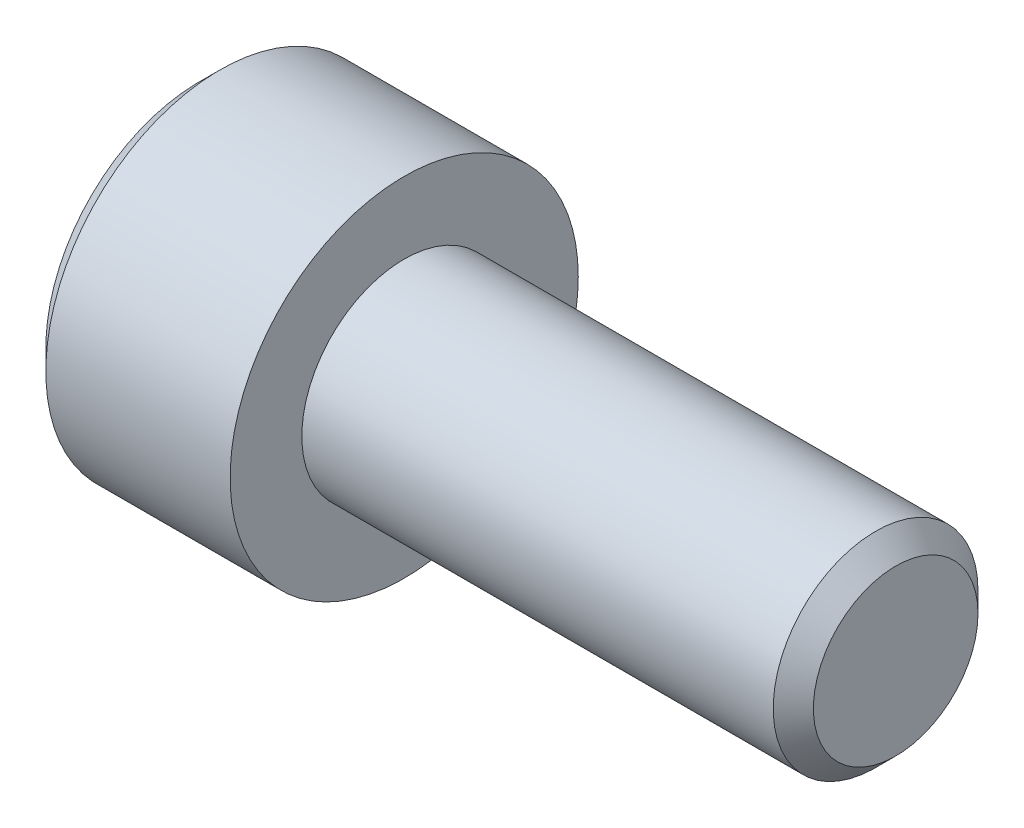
ISO-10303-21;
HEADER;
FILE_DESCRIPTION(('STEP AP214'),'2;1');
FILE_NAME('part.step','',(''),(''),'','','');
FILE_SCHEMA(('AUTOMOTIVE_DESIGN { 1 0 10303 214 1 1 1 1 }'));
ENDSEC;
DATA;
#1=APPLICATION_CONTEXT('core data for automotive mechanical design processes');
#2=APPLICATION_PROTOCOL_DEFINITION('international standard','automotive_design',2000,#1);
#3=PRODUCT_CONTEXT('',#1,'mechanical');
#4=PRODUCT('Part','Part','',(#3));
#5=PRODUCT_RELATED_PRODUCT_CATEGORY('part','',(#4));
#6=PRODUCT_DEFINITION_FORMATION('','',#4);
#7=PRODUCT_DEFINITION_CONTEXT('part definition',#1,'design');
#8=PRODUCT_DEFINITION('design','',#6,#7);
#9=PRODUCT_DEFINITION_SHAPE('','',#8);
#10=(LENGTH_UNIT() NAMED_UNIT(*) SI_UNIT(.MILLI.,.METRE.));
#11=(NAMED_UNIT(*) PLANE_ANGLE_UNIT() SI_UNIT($,.RADIAN.));
#12=(NAMED_UNIT(*) SI_UNIT($,.STERADIAN.) SOLID_ANGLE_UNIT());
#13=UNCERTAINTY_MEASURE_WITH_UNIT(LENGTH_MEASURE(1.E-05),#10,'distance_accuracy_value','');
#14=(GEOMETRIC_REPRESENTATION_CONTEXT(3) GLOBAL_UNCERTAINTY_ASSIGNED_CONTEXT((#13)) GLOBAL_UNIT_ASSIGNED_CONTEXT((#10,
#11,#12)) REPRESENTATION_CONTEXT('',''));
#15=CARTESIAN_POINT('',(0.,0.,0.));
#16=DIRECTION('',(0.,0.,1.));
#17=DIRECTION('',(1.,0.,0.));
#18=AXIS2_PLACEMENT_3D('',#15,#16,#17);
#19=CARTESIAN_POINT('',(-5.,0.,0.));
#20=DIRECTION('',(1.,0.,0.));
#21=DIRECTION('',(0.,0.,-1.));
#22=AXIS2_PLACEMENT_3D('',#19,#20,#21);
#23=PLANE('',#22);
#24=CARTESIAN_POINT('',(-5.,0.,0.));
#25=DIRECTION('',(1.,0.,0.));
#26=DIRECTION('',(0.,0.,-1.));
#27=AXIS2_PLACEMENT_3D('',#24,#25,#26);
#28=CIRCLE('',#27,3.75);
#29=CARTESIAN_POINT('',(-5.,0.,-3.75));
#30=VERTEX_POINT('',#29);
#31=EDGE_CURVE('E10',#30,#30,#28,.T.);
#32=ORIENTED_EDGE('',*,*,#31,.F.);
#33=EDGE_LOOP('',(#32));
#34=FACE_BOUND('',#33,.T.);
#35=DIRECTION('',(0.,0.5,-0.866025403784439));
#36=VECTOR('',#35,1.);
#37=CARTESIAN_POINT('',(-5.,-2.3094010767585,0.));
#38=LINE('',#37,#36);
#39=CARTESIAN_POINT('',(-5.,-2.3094010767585,0.));
#40=VERTEX_POINT('',#39);
#41=CARTESIAN_POINT('',(-5.,-1.15470053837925,-2.));
#42=VERTEX_POINT('',#41);
#43=EDGE_CURVE('E152',#40,#42,#38,.T.);
#44=ORIENTED_EDGE('',*,*,#43,.T.);
#45=DIRECTION('',(0.,1.,0.));
#46=VECTOR('',#45,1.);
#47=CARTESIAN_POINT('',(-5.,-1.15470053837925,-2.));
#48=LINE('',#47,#46);
#49=CARTESIAN_POINT('',(-5.,1.15470053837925,-2.));
#50=VERTEX_POINT('',#49);
#51=EDGE_CURVE('E154',#42,#50,#48,.T.);
#52=ORIENTED_EDGE('',*,*,#51,.T.);
#53=DIRECTION('',(0.,0.5,0.866025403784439));
#54=VECTOR('',#53,1.);
#55=CARTESIAN_POINT('',(-5.,1.15470053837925,-2.));
#56=LINE('',#55,#54);
#57=CARTESIAN_POINT('',(-5.,2.3094010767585,0.));
#58=VERTEX_POINT('',#57);
#59=EDGE_CURVE('E157',#50,#58,#56,.T.);
#60=ORIENTED_EDGE('',*,*,#59,.T.);
#61=DIRECTION('',(0.,-0.5,0.866025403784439));
#62=VECTOR('',#61,1.);
#63=CARTESIAN_POINT('',(-5.,2.3094010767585,0.));
#64=LINE('',#63,#62);
#65=CARTESIAN_POINT('',(-5.,1.15470053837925,2.));
#66=VERTEX_POINT('',#65);
#67=EDGE_CURVE('E99',#58,#66,#64,.T.);
#68=ORIENTED_EDGE('',*,*,#67,.T.);
#69=DIRECTION('',(0.,-1.,0.));
#70=VECTOR('',#69,1.);
#71=CARTESIAN_POINT('',(-5.,1.15470053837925,2.));
#72=LINE('',#71,#70);
#73=CARTESIAN_POINT('',(-5.,-1.15470053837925,2.));
#74=VERTEX_POINT('',#73);
#75=EDGE_CURVE('E159',#66,#74,#72,.T.);
#76=ORIENTED_EDGE('',*,*,#75,.T.);
#77=DIRECTION('',(0.,-0.5,-0.866025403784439));
#78=VECTOR('',#77,1.);
#79=CARTESIAN_POINT('',(-5.,-1.15470053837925,2.));
#80=LINE('',#79,#78);
#81=EDGE_CURVE('E114',#74,#40,#80,.T.);
#82=ORIENTED_EDGE('',*,*,#81,.T.);
#83=EDGE_LOOP('',(#44,#52,#60,#68,#76,#82));
#84=FACE_BOUND('',#83,.T.);
#85=ADVANCED_FACE('F16',(#34,#84),#23,.F.);
#86=CARTESIAN_POINT('',(-5.,0.,0.));
#87=DIRECTION('',(1.,0.,0.));
#88=DIRECTION('',(0.,0.,-1.));
#89=AXIS2_PLACEMENT_3D('',#86,#87,#88);
#90=CONICAL_SURFACE('',#89,3.75,0.785398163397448);
#91=CARTESIAN_POINT('',(-4.5,0.,0.));
#92=DIRECTION('',(1.,0.,0.));
#93=DIRECTION('',(0.,0.,-1.));
#94=AXIS2_PLACEMENT_3D('',#91,#92,#93);
#95=CIRCLE('',#94,4.25);
#96=CARTESIAN_POINT('',(-4.5,0.,-4.25));
#97=VERTEX_POINT('',#96);
#98=EDGE_CURVE('E23',#97,#97,#95,.T.);
#99=ORIENTED_EDGE('',*,*,#98,.F.);
#100=EDGE_LOOP('',(#99));
#101=FACE_BOUND('',#100,.T.);
#102=ORIENTED_EDGE('',*,*,#31,.T.);
#103=EDGE_LOOP('',(#102));
#104=FACE_BOUND('',#103,.T.);
#105=ADVANCED_FACE('F143',(#101,#104),#90,.T.);
#106=CARTESIAN_POINT('',(12.,0.,0.));
#107=DIRECTION('',(1.,0.,0.));
#108=DIRECTION('',(0.,0.,-1.));
#109=AXIS2_PLACEMENT_3D('',#106,#107,#108);
#110=CYLINDRICAL_SURFACE('',#109,4.25);
#111=CARTESIAN_POINT('',(0.,0.,0.));
#112=DIRECTION('',(1.,0.,0.));
#113=DIRECTION('',(0.,0.,-1.));
#114=AXIS2_PLACEMENT_3D('',#111,#112,#113);
#115=CIRCLE('',#114,4.25);
#116=CARTESIAN_POINT('',(0.,0.,-4.25));
#117=VERTEX_POINT('',#116);
#118=EDGE_CURVE('E136',#117,#117,#115,.T.);
#119=ORIENTED_EDGE('',*,*,#118,.F.);
#120=EDGE_LOOP('',(#119));
#121=FACE_BOUND('',#120,.T.);
#122=ORIENTED_EDGE('',*,*,#98,.T.);
#123=EDGE_LOOP('',(#122));
#124=FACE_BOUND('',#123,.T.);
#125=ADVANCED_FACE('F141',(#121,#124),#110,.T.);
#126=CARTESIAN_POINT('',(0.,4.25,0.));
#127=DIRECTION('',(-1.,0.,0.));
#128=DIRECTION('',(0.,0.,1.));
#129=AXIS2_PLACEMENT_3D('',#126,#127,#128);
#130=PLANE('',#129);
#131=CARTESIAN_POINT('',(0.,0.,0.));
#132=DIRECTION('',(1.,0.,0.));
#133=DIRECTION('',(0.,0.,-1.));
#134=AXIS2_PLACEMENT_3D('',#131,#132,#133);
#135=CIRCLE('',#134,2.5);
#136=CARTESIAN_POINT('',(0.,0.,-2.5));
#137=VERTEX_POINT('',#136);
#138=EDGE_CURVE('E133',#137,#137,#135,.T.);
#139=ORIENTED_EDGE('',*,*,#138,.F.);
#140=EDGE_LOOP('',(#139));
#141=FACE_BOUND('',#140,.T.);
#142=ORIENTED_EDGE('',*,*,#118,.T.);
#143=EDGE_LOOP('',(#142));
#144=FACE_BOUND('',#143,.T.);
#145=ADVANCED_FACE('F250',(#141,#144),#130,.F.);
#146=CARTESIAN_POINT('',(12.,0.,0.));
#147=DIRECTION('',(1.,0.,0.));
#148=DIRECTION('',(0.,0.,-1.));
#149=AXIS2_PLACEMENT_3D('',#146,#147,#148);
#150=CYLINDRICAL_SURFACE('',#149,2.5);
#151=CARTESIAN_POINT('',(11.5095,0.,0.));
#152=DIRECTION('',(1.,0.,0.));
#153=DIRECTION('',(0.,0.,-1.));
#154=AXIS2_PLACEMENT_3D('',#151,#152,#153);
#155=CIRCLE('',#154,2.5);
#156=CARTESIAN_POINT('',(11.5095,0.,-2.5));
#157=VERTEX_POINT('',#156);
#158=EDGE_CURVE('E130',#157,#157,#155,.T.);
#159=ORIENTED_EDGE('',*,*,#158,.F.);
#160=EDGE_LOOP('',(#159));
#161=FACE_BOUND('',#160,.T.);
#162=ORIENTED_EDGE('',*,*,#138,.T.);
#163=EDGE_LOOP('',(#162));
#164=FACE_BOUND('',#163,.T.);
#165=ADVANCED_FACE('F246',(#161,#164),#150,.T.);
#166=CARTESIAN_POINT('',(11.5095,0.,0.));
#167=DIRECTION('',(-1.,0.,0.));
#168=DIRECTION('',(0.,0.,1.));
#169=AXIS2_PLACEMENT_3D('',#166,#167,#168);
#170=CONICAL_SURFACE('',#169,2.5,0.785398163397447);
#171=CARTESIAN_POINT('',(12.,0.,0.));
#172=DIRECTION('',(1.,0.,0.));
#173=DIRECTION('',(0.,0.,-1.));
#174=AXIS2_PLACEMENT_3D('',#171,#172,#173);
#175=CIRCLE('',#174,2.0095);
#176=CARTESIAN_POINT('',(12.,0.,-2.0095));
#177=VERTEX_POINT('',#176);
#178=EDGE_CURVE('E126',#177,#177,#175,.T.);
#179=ORIENTED_EDGE('',*,*,#178,.F.);
#180=EDGE_LOOP('',(#179));
#181=FACE_BOUND('',#180,.T.);
#182=ORIENTED_EDGE('',*,*,#158,.T.);
#183=EDGE_LOOP('',(#182));
#184=FACE_BOUND('',#183,.T.);
#185=ADVANCED_FACE('F242',(#181,#184),#170,.T.);
#186=CARTESIAN_POINT('',(12.,2.0095,0.));
#187=DIRECTION('',(-1.,0.,0.));
#188=DIRECTION('',(0.,0.,1.));
#189=AXIS2_PLACEMENT_3D('',#186,#187,#188);
#190=PLANE('',#189);
#191=ORIENTED_EDGE('',*,*,#178,.T.);
#192=EDGE_LOOP('',(#191));
#193=FACE_BOUND('',#192,.T.);
#194=ADVANCED_FACE('F237',(#193),#190,.F.);
#195=CARTESIAN_POINT('',(-2.5,1.15470053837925,2.));
#196=DIRECTION('',(0.,0.,-1.));
#197=DIRECTION('',(-1.,0.,0.));
#198=AXIS2_PLACEMENT_3D('',#195,#196,#197);
#199=PLANE('',#198);
#200=ORIENTED_EDGE('',*,*,#75,.F.);
#201=DIRECTION('',(-1.,0.,0.));
#202=VECTOR('',#201,1.);
#203=CARTESIAN_POINT('',(-2.5,1.15470053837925,2.));
#204=LINE('',#203,#202);
#205=CARTESIAN_POINT('',(-2.5,1.15470053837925,2.));
#206=VERTEX_POINT('',#205);
#207=EDGE_CURVE('E166',#206,#66,#204,.T.);
#208=ORIENTED_EDGE('',*,*,#207,.F.);
#209=DIRECTION('',(0.,-1.,0.));
#210=VECTOR('',#209,1.);
#211=CARTESIAN_POINT('',(-2.5,1.15470053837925,2.));
#212=LINE('',#211,#210);
#213=CARTESIAN_POINT('',(-2.5,0.,2.));
#214=VERTEX_POINT('',#213);
#215=EDGE_CURVE('E96',#206,#214,#212,.T.);
#216=ORIENTED_EDGE('',*,*,#215,.T.);
#217=CARTESIAN_POINT('',(-2.5,-1.15470053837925,2.));
#218=VERTEX_POINT('',#217);
#219=EDGE_CURVE('E88',#214,#218,#212,.T.);
#220=ORIENTED_EDGE('',*,*,#219,.T.);
#221=DIRECTION('',(-1.,0.,0.));
#222=VECTOR('',#221,1.);
#223=CARTESIAN_POINT('',(-2.5,-1.15470053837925,2.));
#224=LINE('',#223,#222);
#225=EDGE_CURVE('E92',#218,#74,#224,.T.);
#226=ORIENTED_EDGE('',*,*,#225,.T.);
#227=EDGE_LOOP('',(#200,#208,#216,#220,#226));
#228=FACE_BOUND('',#227,.T.);
#229=ADVANCED_FACE('F90',(#228),#199,.T.);
#230=CARTESIAN_POINT('',(-2.5,-1.15470053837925,2.));
#231=DIRECTION('',(0.,0.866025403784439,-0.5));
#232=DIRECTION('',(0.,0.5,0.866025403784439));
#233=AXIS2_PLACEMENT_3D('',#230,#231,#232);
#234=PLANE('',#233);
#235=ORIENTED_EDGE('',*,*,#81,.F.);
#236=ORIENTED_EDGE('',*,*,#225,.F.);
#237=DIRECTION('',(0.,-0.5,-0.866025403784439));
#238=VECTOR('',#237,1.);
#239=CARTESIAN_POINT('',(-2.5,-1.15470053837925,2.));
#240=LINE('',#239,#238);
#241=CARTESIAN_POINT('',(-2.5,-1.73205080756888,1.));
#242=VERTEX_POINT('',#241);
#243=EDGE_CURVE('E102',#218,#242,#240,.T.);
#244=ORIENTED_EDGE('',*,*,#243,.T.);
#245=CARTESIAN_POINT('',(-2.5,-2.3094010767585,0.));
#246=VERTEX_POINT('',#245);
#247=EDGE_CURVE('E109',#242,#246,#240,.T.);
#248=ORIENTED_EDGE('',*,*,#247,.T.);
#249=DIRECTION('',(-1.,0.,0.));
#250=VECTOR('',#249,1.);
#251=CARTESIAN_POINT('',(-2.5,-2.3094010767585,0.));
#252=LINE('',#251,#250);
#253=EDGE_CURVE('E116',#246,#40,#252,.T.);
#254=ORIENTED_EDGE('',*,*,#253,.T.);
#255=EDGE_LOOP('',(#235,#236,#244,#248,#254));
#256=FACE_BOUND('',#255,.T.);
#257=ADVANCED_FACE('F111',(#256),#234,.T.);
#258=CARTESIAN_POINT('',(-2.5,-2.3094010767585,0.));
#259=DIRECTION('',(0.,0.866025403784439,0.5));
#260=DIRECTION('',(0.,-0.5,0.866025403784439));
#261=AXIS2_PLACEMENT_3D('',#258,#259,#260);
#262=PLANE('',#261);
#263=ORIENTED_EDGE('',*,*,#43,.F.);
#264=ORIENTED_EDGE('',*,*,#253,.F.);
#265=DIRECTION('',(0.,0.5,-0.866025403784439));
#266=VECTOR('',#265,1.);
#267=CARTESIAN_POINT('',(-2.5,-2.3094010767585,0.));
#268=LINE('',#267,#266);
#269=CARTESIAN_POINT('',(-2.5,-1.73205080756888,-1.));
#270=VERTEX_POINT('',#269);
#271=EDGE_CURVE('E30',#246,#270,#268,.T.);
#272=ORIENTED_EDGE('',*,*,#271,.T.);
#273=CARTESIAN_POINT('',(-2.5,-1.15470053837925,-2.));
#274=VERTEX_POINT('',#273);
#275=EDGE_CURVE('E108',#270,#274,#268,.T.);
#276=ORIENTED_EDGE('',*,*,#275,.T.);
#277=DIRECTION('',(-1.,0.,0.));
#278=VECTOR('',#277,1.);
#279=CARTESIAN_POINT('',(-2.5,-1.15470053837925,-2.));
#280=LINE('',#279,#278);
#281=EDGE_CURVE('E122',#274,#42,#280,.T.);
#282=ORIENTED_EDGE('',*,*,#281,.T.);
#283=EDGE_LOOP('',(#263,#264,#272,#276,#282));
#284=FACE_BOUND('',#283,.T.);
#285=ADVANCED_FACE('F176',(#284),#262,.T.);
#286=CARTESIAN_POINT('',(-2.5,-1.15470053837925,-2.));
#287=DIRECTION('',(0.,0.,1.));
#288=DIRECTION('',(1.,0.,0.));
#289=AXIS2_PLACEMENT_3D('',#286,#287,#288);
#290=PLANE('',#289);
#291=ORIENTED_EDGE('',*,*,#51,.F.);
#292=ORIENTED_EDGE('',*,*,#281,.F.);
#293=DIRECTION('',(0.,1.,0.));
#294=VECTOR('',#293,1.);
#295=CARTESIAN_POINT('',(-2.5,-1.15470053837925,-2.));
#296=LINE('',#295,#294);
#297=CARTESIAN_POINT('',(-2.5,0.,-2.));
#298=VERTEX_POINT('',#297);
#299=EDGE_CURVE('E181',#274,#298,#296,.T.);
#300=ORIENTED_EDGE('',*,*,#299,.T.);
#301=CARTESIAN_POINT('',(-2.5,1.15470053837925,-2.));
#302=VERTEX_POINT('',#301);
#303=EDGE_CURVE('E189',#298,#302,#296,.T.);
#304=ORIENTED_EDGE('',*,*,#303,.T.);
#305=DIRECTION('',(-1.,0.,0.));
#306=VECTOR('',#305,1.);
#307=CARTESIAN_POINT('',(-2.5,1.15470053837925,-2.));
#308=LINE('',#307,#306);
#309=EDGE_CURVE('E173',#302,#50,#308,.T.);
#310=ORIENTED_EDGE('',*,*,#309,.T.);
#311=EDGE_LOOP('',(#291,#292,#300,#304,#310));
#312=FACE_BOUND('',#311,.T.);
#313=ADVANCED_FACE('F180',(#312),#290,.T.);
#314=CARTESIAN_POINT('',(-2.5,1.15470053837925,-2.));
#315=DIRECTION('',(0.,-0.866025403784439,0.5));
#316=DIRECTION('',(0.,-0.5,-0.866025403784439));
#317=AXIS2_PLACEMENT_3D('',#314,#315,#316);
#318=PLANE('',#317);
#319=ORIENTED_EDGE('',*,*,#59,.F.);
#320=ORIENTED_EDGE('',*,*,#309,.F.);
#321=DIRECTION('',(0.,0.5,0.866025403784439));
#322=VECTOR('',#321,1.);
#323=CARTESIAN_POINT('',(-2.5,1.15470053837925,-2.));
#324=LINE('',#323,#322);
#325=CARTESIAN_POINT('',(-2.5,1.73205080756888,-1.));
#326=VERTEX_POINT('',#325);
#327=EDGE_CURVE('E191',#302,#326,#324,.T.);
#328=ORIENTED_EDGE('',*,*,#327,.T.);
#329=CARTESIAN_POINT('',(-2.5,2.3094010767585,0.));
#330=VERTEX_POINT('',#329);
#331=EDGE_CURVE('E188',#326,#330,#324,.T.);
#332=ORIENTED_EDGE('',*,*,#331,.T.);
#333=DIRECTION('',(-1.,0.,0.));
#334=VECTOR('',#333,1.);
#335=CARTESIAN_POINT('',(-2.5,2.3094010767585,0.));
#336=LINE('',#335,#334);
#337=EDGE_CURVE('E169',#330,#58,#336,.T.);
#338=ORIENTED_EDGE('',*,*,#337,.T.);
#339=EDGE_LOOP('',(#319,#320,#328,#332,#338));
#340=FACE_BOUND('',#339,.T.);
#341=ADVANCED_FACE('F219',(#340),#318,.T.);
#342=CARTESIAN_POINT('',(-2.5,2.3094010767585,0.));
#343=DIRECTION('',(0.,-0.866025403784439,-0.5));
#344=DIRECTION('',(0.,0.5,-0.866025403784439));
#345=AXIS2_PLACEMENT_3D('',#342,#343,#344);
#346=PLANE('',#345);
#347=ORIENTED_EDGE('',*,*,#67,.F.);
#348=ORIENTED_EDGE('',*,*,#337,.F.);
#349=DIRECTION('',(0.,-0.5,0.866025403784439));
#350=VECTOR('',#349,1.);
#351=CARTESIAN_POINT('',(-2.5,2.3094010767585,0.));
#352=LINE('',#351,#350);
#353=CARTESIAN_POINT('',(-2.5,1.73205080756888,1.));
#354=VERTEX_POINT('',#353);
#355=EDGE_CURVE('E170',#330,#354,#352,.T.);
#356=ORIENTED_EDGE('',*,*,#355,.T.);
#357=EDGE_CURVE('E196',#354,#206,#352,.T.);
#358=ORIENTED_EDGE('',*,*,#357,.T.);
#359=ORIENTED_EDGE('',*,*,#207,.T.);
#360=EDGE_LOOP('',(#347,#348,#356,#358,#359));
#361=FACE_BOUND('',#360,.T.);
#362=ADVANCED_FACE('F199',(#361),#346,.T.);
#363=CARTESIAN_POINT('',(-2.5,0.,0.));
#364=DIRECTION('',(1.,0.,0.));
#365=DIRECTION('',(0.,0.,-1.));
#366=AXIS2_PLACEMENT_3D('',#363,#364,#365);
#367=PLANE('',#366);
#368=CARTESIAN_POINT('',(-2.5,0.,0.));
#369=DIRECTION('',(1.,0.,0.));
#370=DIRECTION('',(0.,0.,-1.));
#371=AXIS2_PLACEMENT_3D('',#368,#369,#370);
#372=CIRCLE('',#371,2.);
#373=EDGE_CURVE('E115',#298,#326,#372,.T.);
#374=ORIENTED_EDGE('',*,*,#373,.T.);
#375=ORIENTED_EDGE('',*,*,#327,.F.);
#376=ORIENTED_EDGE('',*,*,#303,.F.);
#377=EDGE_LOOP('',(#374,#375,#376));
#378=FACE_BOUND('',#377,.T.);
#379=ADVANCED_FACE('F214',(#378),#367,.F.);
#380=ORIENTED_EDGE('',*,*,#331,.F.);
#381=EDGE_CURVE('E121',#326,#354,#372,.T.);
#382=ORIENTED_EDGE('',*,*,#381,.T.);
#383=ORIENTED_EDGE('',*,*,#355,.F.);
#384=EDGE_LOOP('',(#380,#382,#383));
#385=FACE_BOUND('',#384,.T.);
#386=ADVANCED_FACE('F216',(#385),#367,.F.);
#387=EDGE_CURVE('E127',#354,#214,#372,.T.);
#388=ORIENTED_EDGE('',*,*,#387,.T.);
#389=ORIENTED_EDGE('',*,*,#215,.F.);
#390=ORIENTED_EDGE('',*,*,#357,.F.);
#391=EDGE_LOOP('',(#388,#389,#390));
#392=FACE_BOUND('',#391,.T.);
#393=ADVANCED_FACE('F205',(#392),#367,.F.);
#394=EDGE_CURVE('E104',#214,#242,#372,.T.);
#395=ORIENTED_EDGE('',*,*,#394,.T.);
#396=ORIENTED_EDGE('',*,*,#243,.F.);
#397=ORIENTED_EDGE('',*,*,#219,.F.);
#398=EDGE_LOOP('',(#395,#396,#397));
#399=FACE_BOUND('',#398,.T.);
#400=ADVANCED_FACE('F103',(#399),#367,.F.);
#401=EDGE_CURVE('E208',#242,#270,#372,.T.);
#402=ORIENTED_EDGE('',*,*,#401,.T.);
#403=ORIENTED_EDGE('',*,*,#271,.F.);
#404=ORIENTED_EDGE('',*,*,#247,.F.);
#405=EDGE_LOOP('',(#402,#403,#404));
#406=FACE_BOUND('',#405,.T.);
#407=ADVANCED_FACE('F207',(#406),#367,.F.);
#408=EDGE_CURVE('E119',#270,#298,#372,.T.);
#409=ORIENTED_EDGE('',*,*,#408,.T.);
#410=ORIENTED_EDGE('',*,*,#299,.F.);
#411=ORIENTED_EDGE('',*,*,#275,.F.);
#412=EDGE_LOOP('',(#409,#410,#411));
#413=FACE_BOUND('',#412,.T.);
#414=ADVANCED_FACE('F184',(#413),#367,.F.);
#415=CARTESIAN_POINT('',(-2.5,0.,0.));
#416=DIRECTION('',(-1.,0.,0.));
#417=DIRECTION('',(0.,0.,1.));
#418=AXIS2_PLACEMENT_3D('',#415,#416,#417);
#419=CONICAL_SURFACE('',#418,2.,1.30899693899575);
#420=CARTESIAN_POINT('',(-1.96410161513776,0.,0.));
#421=VERTEX_POINT('',#420);
#422=VERTEX_LOOP('',#421);
#423=FACE_BOUND('',#422,.T.);
#424=ORIENTED_EDGE('',*,*,#381,.F.);
#425=ORIENTED_EDGE('',*,*,#373,.F.);
#426=ORIENTED_EDGE('',*,*,#408,.F.);
#427=ORIENTED_EDGE('',*,*,#401,.F.);
#428=ORIENTED_EDGE('',*,*,#394,.F.);
#429=ORIENTED_EDGE('',*,*,#387,.F.);
#430=EDGE_LOOP('',(#424,#425,#426,#427,#428,#429));
#431=FACE_BOUND('',#430,.T.);
#432=ADVANCED_FACE('F210',(#423,#431),#419,.F.);
#433=CLOSED_SHELL('',(#85,#105,#125,#145,#165,#185,#194,#229,#257,#285,#313,#341,#362,#379,#386,
#393,#400,#407,#414,#432));
#434=MANIFOLD_SOLID_BREP('B1',#433);
#435=ADVANCED_BREP_SHAPE_REPRESENTATION('',(#18,#434),#14);
#436=SHAPE_DEFINITION_REPRESENTATION(#9,#435);
ENDSEC;
END-ISO-10303-21;
